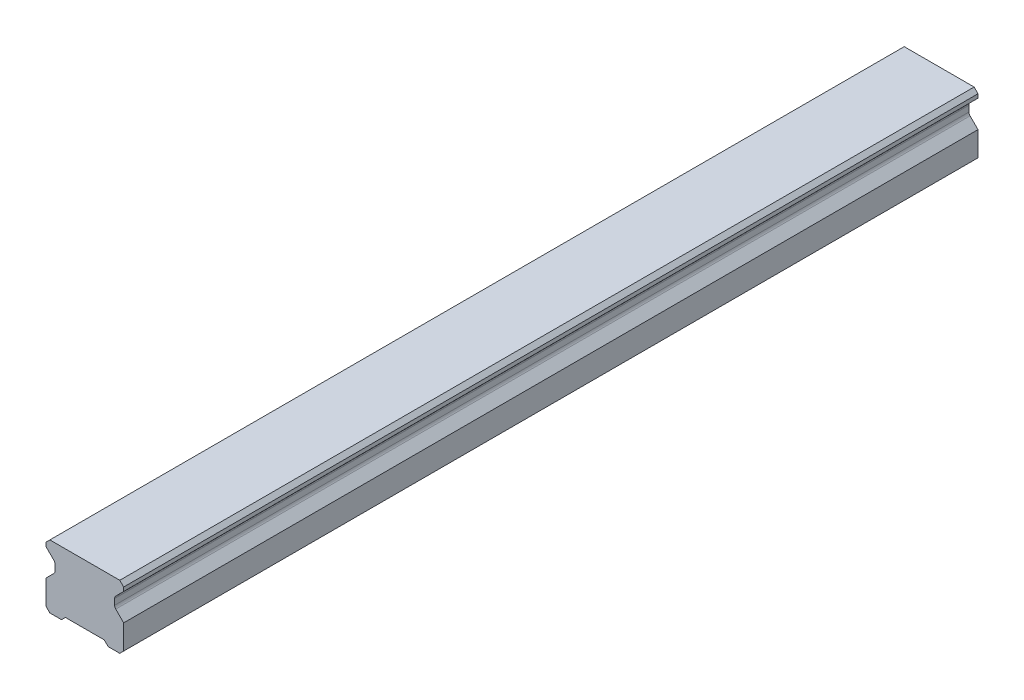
from build123d import *

# Parameters (mm, degrees)
SKETCH1_W           = 20
SKETCH1_H           = 16.3
BOSS_EXTRUDE1_DEPTH = 110
CUT_EXTRUDE1_DEPTH  = 221.829549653
CHAMFER1_SIZE       = 1
FILLET1_R           = 1
CUT_EXTRUDE2_DEPTH  = 221.829549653
SKETCH5_R           = 3
SKETCH5_R_2         = 2.5
CUT_EXTRUDE5_DEPTH  = 10
SKETCH5_2_R         = 2.5
CUT_EXTRUDE6_DEPTH  = 13
LPATTERN2_COUNT     = 4
LPATTERN2_PITCH     = 60


with BuildPart() as part:
    # Sketch1 → Boss-Extrude1 (new, symmetric)
    with BuildSketch(Plane.XY):
        with Locations((0, 8.15)):
            Rectangle(SKETCH1_W, SKETCH1_H)
    extrude(amount=BOSS_EXTRUDE1_DEPTH, both=True)

    # Sketch2 → Cut-Extrude1 (cut, through all)
    with BuildSketch(Plane.XY.offset(110)):
        Polygon((-10, 14.3), (-10, 7.3), (-7.666666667, 9.633333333), (-7.666666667, 11.966666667), align=None)
        Polygon((7.666666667, 11.966666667), (10, 14.3), (10, 7.3), (7.666666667, 9.633333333), align=None)
    extrude(amount=-CUT_EXTRUDE1_DEPTH, mode=Mode.SUBTRACT)

    # Chamfer1
    chamfer1_edges = [part.edges().sort_by_distance(p)[0] for p in [
        (-10, 16.3, 0),
        (10, 16.3, 0),
        (10, 0, 0),
        (-10, 0, 0),
    ]]
    chamfer(chamfer1_edges, length=CHAMFER1_SIZE)

    # Fillet1
    fillet1_edges = [part.edges().sort_by_distance(p)[0] for p in [
        (-7.666666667, 11.966666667, 0),
        (-7.666666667, 9.633333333, 0),
        (7.666666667, 9.633333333, 0),
        (7.666666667, 11.966666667, 0),
    ]]
    fillet(fillet1_edges, radius=FILLET1_R)

    # Sketch3 → Cut-Extrude2 (cut, through all)
    with BuildSketch(Plane.XY.offset(110)):
        Polygon((-6, 0), (-5, 1), (5, 1), (6, 0), align=None)
    extrude(amount=-CUT_EXTRUDE2_DEPTH, mode=Mode.SUBTRACT)

    # Sketch5 → Cut-Extrude5 (cut)
    with BuildSketch(Plane.XZ.offset(-1)):
        with Locations(Location((0, 90, 0), (0, 0, 270))):
            Circle(SKETCH5_R)
        with Locations(Location((0, 90, 0), (0, 0, 270))):
            Circle(SKETCH5_R_2, mode=Mode.SUBTRACT)
    cut_extrude5 = extrude(amount=-CUT_EXTRUDE5_DEPTH, mode=Mode.SUBTRACT)

    # Sketch5_2 → Cut-Extrude6 (cut)
    with BuildSketch(Plane.XZ.offset(-1)):
        with Locations(Location((0, 90, 0), (0, 0, 270))):
            Circle(SKETCH5_2_R)
    cut_extrude6 = extrude(amount=-CUT_EXTRUDE6_DEPTH, mode=Mode.SUBTRACT)

    # Cut-Extrude7 cone 1 section (on through the dimple's axis) → Cut-Extrude7 (revolve, cut)
    with BuildSketch(Plane(origin=(0, 14, 90), x_dir=(0, 0, -1), z_dir=(1, 0, 0))):
        Polygon((0, 0), (2.5, 0), (0, 1.443375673), align=None)
    cut_extrude7 = revolve(axis=Axis((0, 14, 90), (0, 1, 0)), mode=Mode.SUBTRACT)

    # LPattern2: Cut-Extrude5, Cut-Extrude6, Cut-Extrude7 ×4
    with Locations(*[(0, 0, -i * LPATTERN2_PITCH) for i in range(1, LPATTERN2_COUNT)]):
        add(cut_extrude5, mode=Mode.SUBTRACT)
        add(cut_extrude6, mode=Mode.SUBTRACT)
        add(cut_extrude7, mode=Mode.SUBTRACT)


solid = part.part
